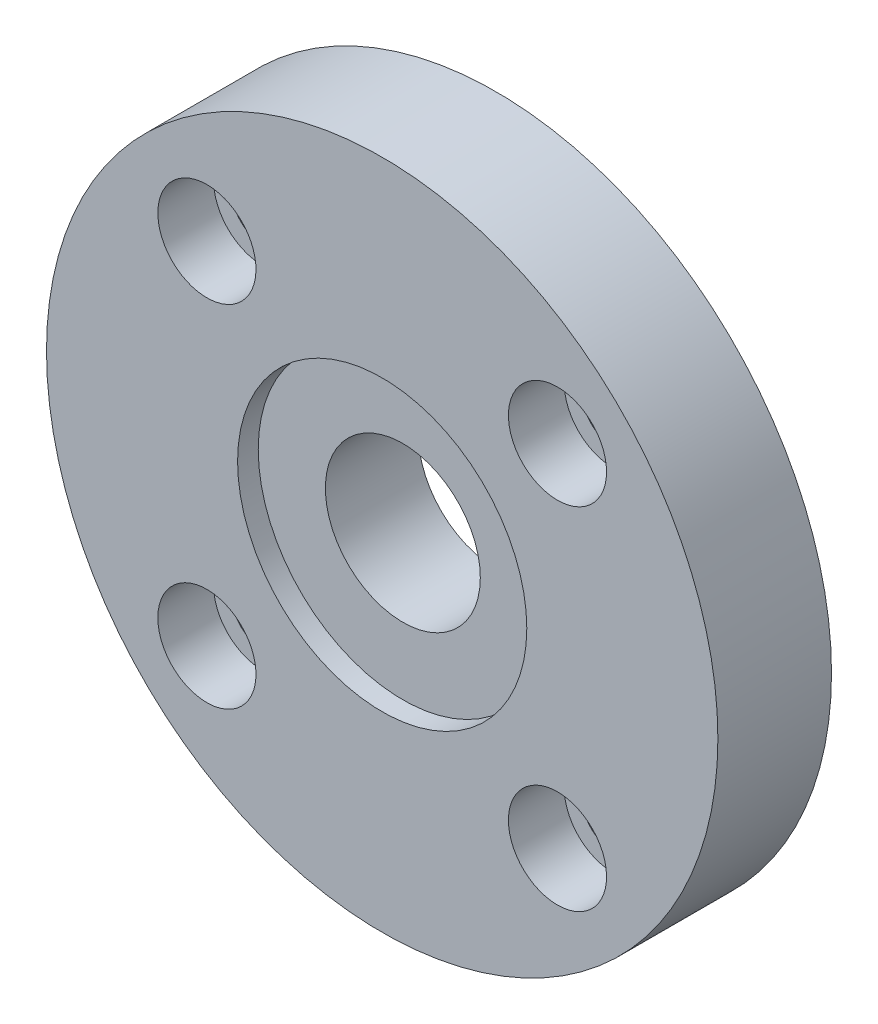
ISO-10303-21;
HEADER;
FILE_DESCRIPTION(('STEP AP214'),'2;1');
FILE_NAME('part.step','',(''),(''),'','','');
FILE_SCHEMA(('AUTOMOTIVE_DESIGN { 1 0 10303 214 1 1 1 1 }'));
ENDSEC;
DATA;
#1=APPLICATION_CONTEXT('core data for automotive mechanical design processes');
#2=APPLICATION_PROTOCOL_DEFINITION('international standard','automotive_design',2000,#1);
#3=PRODUCT_CONTEXT('',#1,'mechanical');
#4=PRODUCT('Part','Part','',(#3));
#5=PRODUCT_RELATED_PRODUCT_CATEGORY('part','',(#4));
#6=PRODUCT_DEFINITION_FORMATION('','',#4);
#7=PRODUCT_DEFINITION_CONTEXT('part definition',#1,'design');
#8=PRODUCT_DEFINITION('design','',#6,#7);
#9=PRODUCT_DEFINITION_SHAPE('','',#8);
#10=(LENGTH_UNIT() NAMED_UNIT(*) SI_UNIT(.MILLI.,.METRE.));
#11=(NAMED_UNIT(*) PLANE_ANGLE_UNIT() SI_UNIT($,.RADIAN.));
#12=(NAMED_UNIT(*) SI_UNIT($,.STERADIAN.) SOLID_ANGLE_UNIT());
#13=UNCERTAINTY_MEASURE_WITH_UNIT(LENGTH_MEASURE(1.E-05),#10,'distance_accuracy_value','');
#14=(GEOMETRIC_REPRESENTATION_CONTEXT(3) GLOBAL_UNCERTAINTY_ASSIGNED_CONTEXT((#13)) GLOBAL_UNIT_ASSIGNED_CONTEXT((#10,
#11,#12)) REPRESENTATION_CONTEXT('',''));
#15=CARTESIAN_POINT('',(0.,0.,0.));
#16=DIRECTION('',(0.,0.,1.));
#17=DIRECTION('',(1.,0.,0.));
#18=AXIS2_PLACEMENT_3D('',#15,#16,#17);
#19=CARTESIAN_POINT('',(0.,0.,11.));
#20=DIRECTION('',(0.,0.,-1.));
#21=DIRECTION('',(-1.,0.,0.));
#22=AXIS2_PLACEMENT_3D('',#19,#20,#21);
#23=CYLINDRICAL_SURFACE('',#22,7.5);
#24=CARTESIAN_POINT('',(0.,0.,0.));
#25=DIRECTION('',(0.,0.,1.));
#26=DIRECTION('',(1.,0.,0.));
#27=AXIS2_PLACEMENT_3D('',#24,#25,#26);
#28=CIRCLE('',#27,7.5);
#29=CARTESIAN_POINT('',(7.5,0.,0.));
#30=VERTEX_POINT('',#29);
#31=EDGE_CURVE('E25',#30,#30,#28,.T.);
#32=ORIENTED_EDGE('',*,*,#31,.F.);
#33=EDGE_LOOP('',(#32));
#34=FACE_BOUND('',#33,.T.);
#35=CARTESIAN_POINT('',(0.,0.,9.));
#36=DIRECTION('',(0.,0.,1.));
#37=DIRECTION('',(1.,0.,0.));
#38=AXIS2_PLACEMENT_3D('',#35,#36,#37);
#39=CIRCLE('',#38,7.5);
#40=CARTESIAN_POINT('',(7.5,0.,9.));
#41=VERTEX_POINT('',#40);
#42=EDGE_CURVE('E16',#41,#41,#39,.T.);
#43=ORIENTED_EDGE('',*,*,#42,.T.);
#44=EDGE_LOOP('',(#43));
#45=FACE_BOUND('',#44,.T.);
#46=ADVANCED_FACE('F12',(#34,#45),#23,.F.);
#47=CARTESIAN_POINT('',(-16.9705627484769,16.9705627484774,0.));
#48=DIRECTION('',(0.,0.,1.));
#49=DIRECTION('',(1.,0.,0.));
#50=AXIS2_PLACEMENT_3D('',#47,#48,#49);
#51=CYLINDRICAL_SURFACE('',#50,3.);
#52=CARTESIAN_POINT('',(-16.9705627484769,16.9705627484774,0.));
#53=DIRECTION('',(0.,0.,1.));
#54=DIRECTION('',(0.,1.,0.));
#55=AXIS2_PLACEMENT_3D('',#52,#53,#54);
#56=CIRCLE('',#55,3.);
#57=CARTESIAN_POINT('',(-16.9705627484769,19.9705627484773,0.));
#58=VERTEX_POINT('',#57);
#59=EDGE_CURVE('E37',#58,#58,#56,.T.);
#60=ORIENTED_EDGE('',*,*,#59,.F.);
#61=EDGE_LOOP('',(#60));
#62=FACE_BOUND('',#61,.T.);
#63=CARTESIAN_POINT('',(-16.9705627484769,16.9705627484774,5.6));
#64=DIRECTION('',(0.,0.,1.));
#65=DIRECTION('',(1.,0.,0.));
#66=AXIS2_PLACEMENT_3D('',#63,#64,#65);
#67=CIRCLE('',#66,3.);
#68=CARTESIAN_POINT('',(-13.9705627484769,16.9705627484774,5.6));
#69=VERTEX_POINT('',#68);
#70=EDGE_CURVE('E43',#69,#69,#67,.F.);
#71=ORIENTED_EDGE('',*,*,#70,.F.);
#72=EDGE_LOOP('',(#71));
#73=FACE_BOUND('',#72,.T.);
#74=ADVANCED_FACE('F87',(#62,#73),#51,.F.);
#75=CARTESIAN_POINT('',(-16.9705627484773,-16.970562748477,0.));
#76=DIRECTION('',(0.,0.,1.));
#77=DIRECTION('',(1.,0.,0.));
#78=AXIS2_PLACEMENT_3D('',#75,#76,#77);
#79=CYLINDRICAL_SURFACE('',#78,3.);
#80=CARTESIAN_POINT('',(-16.9705627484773,-16.970562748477,0.));
#81=DIRECTION('',(0.,0.,1.));
#82=DIRECTION('',(-1.,0.,0.));
#83=AXIS2_PLACEMENT_3D('',#80,#81,#82);
#84=CIRCLE('',#83,3.);
#85=CARTESIAN_POINT('',(-19.9705627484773,-16.970562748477,0.));
#86=VERTEX_POINT('',#85);
#87=EDGE_CURVE('E68',#86,#86,#84,.T.);
#88=ORIENTED_EDGE('',*,*,#87,.F.);
#89=EDGE_LOOP('',(#88));
#90=FACE_BOUND('',#89,.T.);
#91=CARTESIAN_POINT('',(-16.9705627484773,-16.970562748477,5.6));
#92=DIRECTION('',(0.,0.,1.));
#93=DIRECTION('',(1.,0.,0.));
#94=AXIS2_PLACEMENT_3D('',#91,#92,#93);
#95=CIRCLE('',#94,3.);
#96=CARTESIAN_POINT('',(-13.9705627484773,-16.970562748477,5.6));
#97=VERTEX_POINT('',#96);
#98=EDGE_CURVE('E39',#97,#97,#95,.F.);
#99=ORIENTED_EDGE('',*,*,#98,.F.);
#100=EDGE_LOOP('',(#99));
#101=FACE_BOUND('',#100,.T.);
#102=ADVANCED_FACE('F160',(#90,#101),#79,.F.);
#103=CARTESIAN_POINT('',(16.9705627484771,-16.9705627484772,0.));
#104=DIRECTION('',(0.,0.,1.));
#105=DIRECTION('',(1.,0.,0.));
#106=AXIS2_PLACEMENT_3D('',#103,#104,#105);
#107=CYLINDRICAL_SURFACE('',#106,3.);
#108=CARTESIAN_POINT('',(16.9705627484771,-16.9705627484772,0.));
#109=DIRECTION('',(0.,0.,1.));
#110=DIRECTION('',(0.,-1.,0.));
#111=AXIS2_PLACEMENT_3D('',#108,#109,#110);
#112=CIRCLE('',#111,3.);
#113=CARTESIAN_POINT('',(16.970562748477,-19.9705627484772,0.));
#114=VERTEX_POINT('',#113);
#115=EDGE_CURVE('E71',#114,#114,#112,.T.);
#116=ORIENTED_EDGE('',*,*,#115,.F.);
#117=EDGE_LOOP('',(#116));
#118=FACE_BOUND('',#117,.T.);
#119=CARTESIAN_POINT('',(16.9705627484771,-16.9705627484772,5.6));
#120=DIRECTION('',(0.,0.,1.));
#121=DIRECTION('',(1.,0.,0.));
#122=AXIS2_PLACEMENT_3D('',#119,#120,#121);
#123=CIRCLE('',#122,3.);
#124=CARTESIAN_POINT('',(19.970562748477,-16.9705627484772,5.6));
#125=VERTEX_POINT('',#124);
#126=EDGE_CURVE('E34',#125,#125,#123,.F.);
#127=ORIENTED_EDGE('',*,*,#126,.F.);
#128=EDGE_LOOP('',(#127));
#129=FACE_BOUND('',#128,.T.);
#130=ADVANCED_FACE('F135',(#118,#129),#107,.F.);
#131=CARTESIAN_POINT('',(16.9705627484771,16.9705627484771,0.));
#132=DIRECTION('',(0.,0.,1.));
#133=DIRECTION('',(1.,0.,0.));
#134=AXIS2_PLACEMENT_3D('',#131,#132,#133);
#135=CYLINDRICAL_SURFACE('',#134,3.);
#136=CARTESIAN_POINT('',(16.9705627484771,16.9705627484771,0.));
#137=DIRECTION('',(0.,0.,1.));
#138=DIRECTION('',(1.,0.,0.));
#139=AXIS2_PLACEMENT_3D('',#136,#137,#138);
#140=CIRCLE('',#139,3.);
#141=CARTESIAN_POINT('',(19.9705627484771,16.9705627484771,0.));
#142=VERTEX_POINT('',#141);
#143=EDGE_CURVE('E32',#142,#142,#140,.T.);
#144=ORIENTED_EDGE('',*,*,#143,.F.);
#145=EDGE_LOOP('',(#144));
#146=FACE_BOUND('',#145,.T.);
#147=CARTESIAN_POINT('',(16.9705627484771,16.9705627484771,5.6));
#148=DIRECTION('',(0.,0.,1.));
#149=DIRECTION('',(1.,0.,0.));
#150=AXIS2_PLACEMENT_3D('',#147,#148,#149);
#151=CIRCLE('',#150,3.);
#152=CARTESIAN_POINT('',(19.9705627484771,16.9705627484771,5.6));
#153=VERTEX_POINT('',#152);
#154=EDGE_CURVE('E29',#153,#153,#151,.F.);
#155=ORIENTED_EDGE('',*,*,#154,.F.);
#156=EDGE_LOOP('',(#155));
#157=FACE_BOUND('',#156,.T.);
#158=ADVANCED_FACE('F106',(#146,#157),#135,.F.);
#159=CARTESIAN_POINT('',(0.,0.,11.));
#160=DIRECTION('',(0.,0.,1.));
#161=DIRECTION('',(1.,0.,0.));
#162=AXIS2_PLACEMENT_3D('',#159,#160,#161);
#163=PLANE('',#162);
#164=CARTESIAN_POINT('',(0.,0.,11.));
#165=DIRECTION('',(0.,0.,1.));
#166=DIRECTION('',(1.,0.,0.));
#167=AXIS2_PLACEMENT_3D('',#164,#165,#166);
#168=CIRCLE('',#167,14.);
#169=CARTESIAN_POINT('',(14.,0.,11.));
#170=VERTEX_POINT('',#169);
#171=EDGE_CURVE('E94',#170,#170,#168,.T.);
#172=ORIENTED_EDGE('',*,*,#171,.F.);
#173=EDGE_LOOP('',(#172));
#174=FACE_BOUND('',#173,.T.);
#175=CARTESIAN_POINT('',(-16.9705627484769,16.9705627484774,11.));
#176=DIRECTION('',(0.,0.,1.));
#177=DIRECTION('',(0.,1.,0.));
#178=AXIS2_PLACEMENT_3D('',#175,#176,#177);
#179=CIRCLE('',#178,4.75);
#180=CARTESIAN_POINT('',(-16.9705627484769,21.7205627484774,11.));
#181=VERTEX_POINT('',#180);
#182=EDGE_CURVE('E52',#181,#181,#179,.T.);
#183=ORIENTED_EDGE('',*,*,#182,.F.);
#184=EDGE_LOOP('',(#183));
#185=FACE_BOUND('',#184,.T.);
#186=CARTESIAN_POINT('',(-16.9705627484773,-16.970562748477,11.));
#187=DIRECTION('',(0.,0.,1.));
#188=DIRECTION('',(-1.,0.,0.));
#189=AXIS2_PLACEMENT_3D('',#186,#187,#188);
#190=CIRCLE('',#189,4.75);
#191=CARTESIAN_POINT('',(-21.7205627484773,-16.970562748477,11.));
#192=VERTEX_POINT('',#191);
#193=EDGE_CURVE('E45',#192,#192,#190,.T.);
#194=ORIENTED_EDGE('',*,*,#193,.F.);
#195=EDGE_LOOP('',(#194));
#196=FACE_BOUND('',#195,.T.);
#197=CARTESIAN_POINT('',(16.9705627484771,-16.9705627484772,11.));
#198=DIRECTION('',(0.,0.,1.));
#199=DIRECTION('',(0.,-1.,0.));
#200=AXIS2_PLACEMENT_3D('',#197,#198,#199);
#201=CIRCLE('',#200,4.75);
#202=CARTESIAN_POINT('',(16.970562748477,-21.7205627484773,11.));
#203=VERTEX_POINT('',#202);
#204=EDGE_CURVE('E41',#203,#203,#201,.T.);
#205=ORIENTED_EDGE('',*,*,#204,.F.);
#206=EDGE_LOOP('',(#205));
#207=FACE_BOUND('',#206,.T.);
#208=CARTESIAN_POINT('',(16.9705627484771,16.9705627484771,11.));
#209=DIRECTION('',(0.,0.,1.));
#210=DIRECTION('',(1.,0.,0.));
#211=AXIS2_PLACEMENT_3D('',#208,#209,#210);
#212=CIRCLE('',#211,4.75);
#213=CARTESIAN_POINT('',(21.7205627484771,16.9705627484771,11.));
#214=VERTEX_POINT('',#213);
#215=EDGE_CURVE('E74',#214,#214,#212,.T.);
#216=ORIENTED_EDGE('',*,*,#215,.F.);
#217=EDGE_LOOP('',(#216));
#218=FACE_BOUND('',#217,.T.);
#219=CARTESIAN_POINT('',(0.,0.,11.));
#220=DIRECTION('',(0.,0.,1.));
#221=DIRECTION('',(1.,0.,0.));
#222=AXIS2_PLACEMENT_3D('',#219,#220,#221);
#223=CIRCLE('',#222,32.5);
#224=CARTESIAN_POINT('',(32.5,0.,11.));
#225=VERTEX_POINT('',#224);
#226=EDGE_CURVE('E8',#225,#225,#223,.T.);
#227=ORIENTED_EDGE('',*,*,#226,.T.);
#228=EDGE_LOOP('',(#227));
#229=FACE_BOUND('',#228,.T.);
#230=ADVANCED_FACE('F103',(#174,#185,#196,#207,#218,#229),#163,.T.);
#231=CARTESIAN_POINT('',(0.,0.,0.));
#232=DIRECTION('',(0.,0.,1.));
#233=DIRECTION('',(1.,0.,0.));
#234=AXIS2_PLACEMENT_3D('',#231,#232,#233);
#235=PLANE('',#234);
#236=ORIENTED_EDGE('',*,*,#59,.T.);
#237=EDGE_LOOP('',(#236));
#238=FACE_BOUND('',#237,.T.);
#239=ORIENTED_EDGE('',*,*,#87,.T.);
#240=EDGE_LOOP('',(#239));
#241=FACE_BOUND('',#240,.T.);
#242=ORIENTED_EDGE('',*,*,#115,.T.);
#243=EDGE_LOOP('',(#242));
#244=FACE_BOUND('',#243,.T.);
#245=ORIENTED_EDGE('',*,*,#143,.T.);
#246=EDGE_LOOP('',(#245));
#247=FACE_BOUND('',#246,.T.);
#248=CARTESIAN_POINT('',(0.,0.,0.));
#249=DIRECTION('',(0.,0.,1.));
#250=DIRECTION('',(1.,0.,0.));
#251=AXIS2_PLACEMENT_3D('',#248,#249,#250);
#252=CIRCLE('',#251,32.5);
#253=CARTESIAN_POINT('',(32.5,0.,0.));
#254=VERTEX_POINT('',#253);
#255=EDGE_CURVE('E20',#254,#254,#252,.T.);
#256=ORIENTED_EDGE('',*,*,#255,.F.);
#257=EDGE_LOOP('',(#256));
#258=FACE_BOUND('',#257,.T.);
#259=ORIENTED_EDGE('',*,*,#31,.T.);
#260=EDGE_LOOP('',(#259));
#261=FACE_BOUND('',#260,.T.);
#262=ADVANCED_FACE('F83',(#238,#241,#244,#247,#258,#261),#235,.F.);
#263=CARTESIAN_POINT('',(0.,0.,11.));
#264=DIRECTION('',(0.,0.,-1.));
#265=DIRECTION('',(-1.,0.,0.));
#266=AXIS2_PLACEMENT_3D('',#263,#264,#265);
#267=CYLINDRICAL_SURFACE('',#266,32.5);
#268=ORIENTED_EDGE('',*,*,#226,.F.);
#269=EDGE_LOOP('',(#268));
#270=FACE_BOUND('',#269,.T.);
#271=ORIENTED_EDGE('',*,*,#255,.T.);
#272=EDGE_LOOP('',(#271));
#273=FACE_BOUND('',#272,.T.);
#274=ADVANCED_FACE('F14',(#270,#273),#267,.T.);
#275=CARTESIAN_POINT('',(16.9705627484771,16.9705627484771,5.6));
#276=DIRECTION('',(0.,0.,1.));
#277=DIRECTION('',(1.,0.,0.));
#278=AXIS2_PLACEMENT_3D('',#275,#276,#277);
#279=PLANE('',#278);
#280=CARTESIAN_POINT('',(16.9705627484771,16.9705627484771,5.6));
#281=DIRECTION('',(0.,0.,1.));
#282=DIRECTION('',(1.,0.,0.));
#283=AXIS2_PLACEMENT_3D('',#280,#281,#282);
#284=CIRCLE('',#283,4.75);
#285=CARTESIAN_POINT('',(21.7205627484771,16.9705627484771,5.6));
#286=VERTEX_POINT('',#285);
#287=EDGE_CURVE('E33',#286,#286,#284,.T.);
#288=ORIENTED_EDGE('',*,*,#287,.T.);
#289=EDGE_LOOP('',(#288));
#290=FACE_BOUND('',#289,.T.);
#291=ORIENTED_EDGE('',*,*,#154,.T.);
#292=EDGE_LOOP('',(#291));
#293=FACE_BOUND('',#292,.T.);
#294=ADVANCED_FACE('F118',(#290,#293),#279,.T.);
#295=CARTESIAN_POINT('',(16.9705627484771,16.9705627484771,5.6));
#296=DIRECTION('',(0.,0.,1.));
#297=DIRECTION('',(1.,0.,0.));
#298=AXIS2_PLACEMENT_3D('',#295,#296,#297);
#299=CYLINDRICAL_SURFACE('',#298,4.75);
#300=ORIENTED_EDGE('',*,*,#287,.F.);
#301=EDGE_LOOP('',(#300));
#302=FACE_BOUND('',#301,.T.);
#303=ORIENTED_EDGE('',*,*,#215,.T.);
#304=EDGE_LOOP('',(#303));
#305=FACE_BOUND('',#304,.T.);
#306=ADVANCED_FACE('F115',(#302,#305),#299,.F.);
#307=CARTESIAN_POINT('',(16.9705627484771,-16.9705627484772,5.6));
#308=DIRECTION('',(0.,0.,1.));
#309=DIRECTION('',(0.,-1.,0.));
#310=AXIS2_PLACEMENT_3D('',#307,#308,#309);
#311=PLANE('',#310);
#312=CARTESIAN_POINT('',(16.9705627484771,-16.9705627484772,5.6));
#313=DIRECTION('',(0.,0.,1.));
#314=DIRECTION('',(0.,-1.,0.));
#315=AXIS2_PLACEMENT_3D('',#312,#313,#314);
#316=CIRCLE('',#315,4.75);
#317=CARTESIAN_POINT('',(16.970562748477,-21.7205627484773,5.6));
#318=VERTEX_POINT('',#317);
#319=EDGE_CURVE('E38',#318,#318,#316,.T.);
#320=ORIENTED_EDGE('',*,*,#319,.T.);
#321=EDGE_LOOP('',(#320));
#322=FACE_BOUND('',#321,.T.);
#323=ORIENTED_EDGE('',*,*,#126,.T.);
#324=EDGE_LOOP('',(#323));
#325=FACE_BOUND('',#324,.T.);
#326=ADVANCED_FACE('F117',(#322,#325),#311,.T.);
#327=CARTESIAN_POINT('',(16.9705627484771,-16.9705627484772,5.6));
#328=DIRECTION('',(0.,0.,1.));
#329=DIRECTION('',(1.,0.,0.));
#330=AXIS2_PLACEMENT_3D('',#327,#328,#329);
#331=CYLINDRICAL_SURFACE('',#330,4.75);
#332=ORIENTED_EDGE('',*,*,#319,.F.);
#333=EDGE_LOOP('',(#332));
#334=FACE_BOUND('',#333,.T.);
#335=ORIENTED_EDGE('',*,*,#204,.T.);
#336=EDGE_LOOP('',(#335));
#337=FACE_BOUND('',#336,.T.);
#338=ADVANCED_FACE('F126',(#334,#337),#331,.F.);
#339=CARTESIAN_POINT('',(-16.9705627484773,-16.970562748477,5.6));
#340=DIRECTION('',(0.,0.,1.));
#341=DIRECTION('',(-1.,0.,0.));
#342=AXIS2_PLACEMENT_3D('',#339,#340,#341);
#343=PLANE('',#342);
#344=CARTESIAN_POINT('',(-16.9705627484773,-16.970562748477,5.6));
#345=DIRECTION('',(0.,0.,1.));
#346=DIRECTION('',(-1.,0.,0.));
#347=AXIS2_PLACEMENT_3D('',#344,#345,#346);
#348=CIRCLE('',#347,4.75);
#349=CARTESIAN_POINT('',(-21.7205627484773,-16.970562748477,5.6));
#350=VERTEX_POINT('',#349);
#351=EDGE_CURVE('E42',#350,#350,#348,.T.);
#352=ORIENTED_EDGE('',*,*,#351,.T.);
#353=EDGE_LOOP('',(#352));
#354=FACE_BOUND('',#353,.T.);
#355=ORIENTED_EDGE('',*,*,#98,.T.);
#356=EDGE_LOOP('',(#355));
#357=FACE_BOUND('',#356,.T.);
#358=ADVANCED_FACE('F173',(#354,#357),#343,.T.);
#359=CARTESIAN_POINT('',(-16.9705627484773,-16.970562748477,5.6));
#360=DIRECTION('',(0.,0.,1.));
#361=DIRECTION('',(1.,0.,0.));
#362=AXIS2_PLACEMENT_3D('',#359,#360,#361);
#363=CYLINDRICAL_SURFACE('',#362,4.75);
#364=ORIENTED_EDGE('',*,*,#351,.F.);
#365=EDGE_LOOP('',(#364));
#366=FACE_BOUND('',#365,.T.);
#367=ORIENTED_EDGE('',*,*,#193,.T.);
#368=EDGE_LOOP('',(#367));
#369=FACE_BOUND('',#368,.T.);
#370=ADVANCED_FACE('F176',(#366,#369),#363,.F.);
#371=CARTESIAN_POINT('',(-16.9705627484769,16.9705627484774,5.6));
#372=DIRECTION('',(0.,0.,1.));
#373=DIRECTION('',(0.,1.,0.));
#374=AXIS2_PLACEMENT_3D('',#371,#372,#373);
#375=PLANE('',#374);
#376=CARTESIAN_POINT('',(-16.9705627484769,16.9705627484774,5.6));
#377=DIRECTION('',(0.,0.,1.));
#378=DIRECTION('',(0.,1.,0.));
#379=AXIS2_PLACEMENT_3D('',#376,#377,#378);
#380=CIRCLE('',#379,4.75);
#381=CARTESIAN_POINT('',(-16.9705627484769,21.7205627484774,5.6));
#382=VERTEX_POINT('',#381);
#383=EDGE_CURVE('E46',#382,#382,#380,.T.);
#384=ORIENTED_EDGE('',*,*,#383,.T.);
#385=EDGE_LOOP('',(#384));
#386=FACE_BOUND('',#385,.T.);
#387=ORIENTED_EDGE('',*,*,#70,.T.);
#388=EDGE_LOOP('',(#387));
#389=FACE_BOUND('',#388,.T.);
#390=ADVANCED_FACE('F179',(#386,#389),#375,.T.);
#391=CARTESIAN_POINT('',(-16.9705627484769,16.9705627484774,5.6));
#392=DIRECTION('',(0.,0.,1.));
#393=DIRECTION('',(1.,0.,0.));
#394=AXIS2_PLACEMENT_3D('',#391,#392,#393);
#395=CYLINDRICAL_SURFACE('',#394,4.75);
#396=ORIENTED_EDGE('',*,*,#383,.F.);
#397=EDGE_LOOP('',(#396));
#398=FACE_BOUND('',#397,.T.);
#399=ORIENTED_EDGE('',*,*,#182,.T.);
#400=EDGE_LOOP('',(#399));
#401=FACE_BOUND('',#400,.T.);
#402=ADVANCED_FACE('F184',(#398,#401),#395,.F.);
#403=CARTESIAN_POINT('',(0.,0.,9.));
#404=DIRECTION('',(0.,0.,1.));
#405=DIRECTION('',(1.,0.,0.));
#406=AXIS2_PLACEMENT_3D('',#403,#404,#405);
#407=CYLINDRICAL_SURFACE('',#406,14.);
#408=CARTESIAN_POINT('',(0.,0.,9.));
#409=DIRECTION('',(0.,0.,1.));
#410=DIRECTION('',(1.,0.,0.));
#411=AXIS2_PLACEMENT_3D('',#408,#409,#410);
#412=CIRCLE('',#411,14.);
#413=CARTESIAN_POINT('',(14.,0.,9.));
#414=VERTEX_POINT('',#413);
#415=EDGE_CURVE('E92',#414,#414,#412,.T.);
#416=ORIENTED_EDGE('',*,*,#415,.F.);
#417=EDGE_LOOP('',(#416));
#418=FACE_BOUND('',#417,.T.);
#419=ORIENTED_EDGE('',*,*,#171,.T.);
#420=EDGE_LOOP('',(#419));
#421=FACE_BOUND('',#420,.T.);
#422=ADVANCED_FACE('F101',(#418,#421),#407,.F.);
#423=CARTESIAN_POINT('',(0.,0.,9.));
#424=DIRECTION('',(0.,0.,1.));
#425=DIRECTION('',(1.,0.,0.));
#426=AXIS2_PLACEMENT_3D('',#423,#424,#425);
#427=PLANE('',#426);
#428=ORIENTED_EDGE('',*,*,#42,.F.);
#429=EDGE_LOOP('',(#428));
#430=FACE_BOUND('',#429,.T.);
#431=ORIENTED_EDGE('',*,*,#415,.T.);
#432=EDGE_LOOP('',(#431));
#433=FACE_BOUND('',#432,.T.);
#434=ADVANCED_FACE('F188',(#430,#433),#427,.T.);
#435=CLOSED_SHELL('',(#46,#74,#102,#130,#158,#230,#262,#274,#294,#306,#326,#338,#358,#370,#390,
#402,#422,#434));
#436=MANIFOLD_SOLID_BREP('B1',#435);
#437=ADVANCED_BREP_SHAPE_REPRESENTATION('',(#18,#436),#14);
#438=SHAPE_DEFINITION_REPRESENTATION(#9,#437);
ENDSEC;
END-ISO-10303-21;
